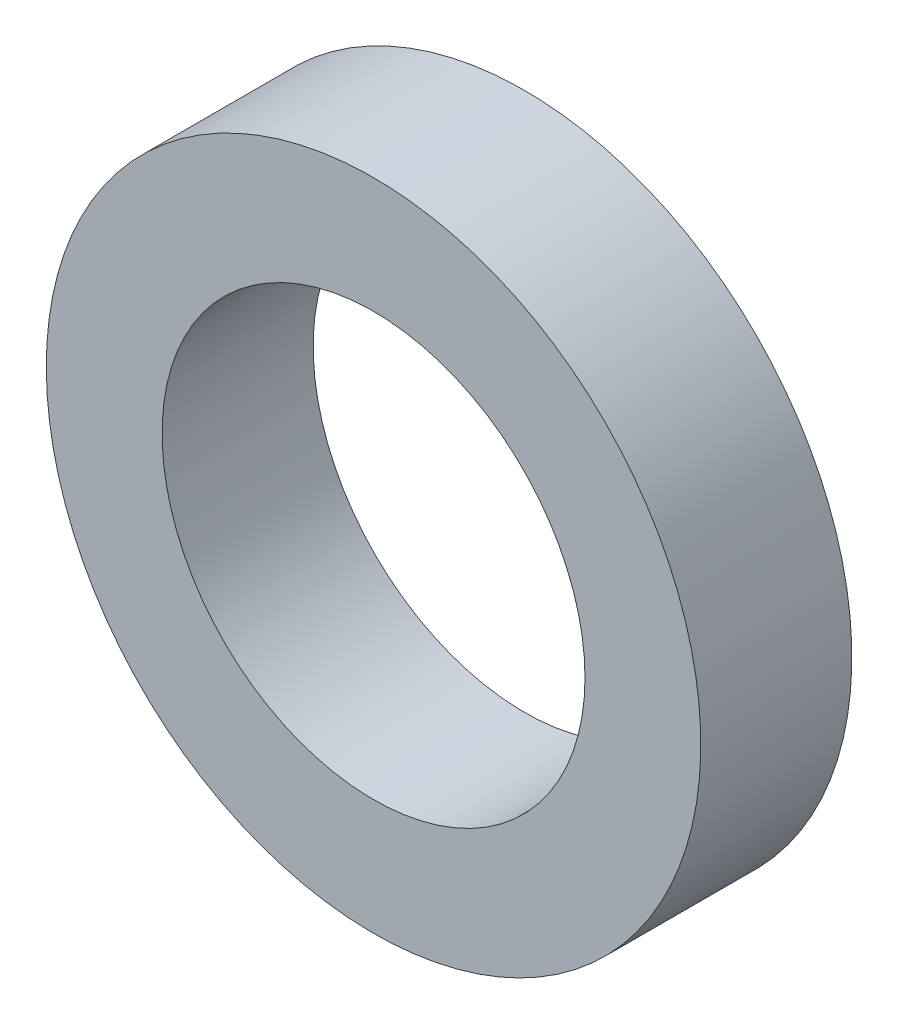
ISO-10303-21;
HEADER;
FILE_DESCRIPTION(('STEP AP214'),'2;1');
FILE_NAME('part.step','',(''),(''),'','','');
FILE_SCHEMA(('AUTOMOTIVE_DESIGN { 1 0 10303 214 1 1 1 1 }'));
ENDSEC;
DATA;
#1=APPLICATION_CONTEXT('core data for automotive mechanical design processes');
#2=APPLICATION_PROTOCOL_DEFINITION('international standard','automotive_design',2000,#1);
#3=PRODUCT_CONTEXT('',#1,'mechanical');
#4=PRODUCT('Part','Part','',(#3));
#5=PRODUCT_RELATED_PRODUCT_CATEGORY('part','',(#4));
#6=PRODUCT_DEFINITION_FORMATION('','',#4);
#7=PRODUCT_DEFINITION_CONTEXT('part definition',#1,'design');
#8=PRODUCT_DEFINITION('design','',#6,#7);
#9=PRODUCT_DEFINITION_SHAPE('','',#8);
#10=(LENGTH_UNIT() NAMED_UNIT(*) SI_UNIT(.MILLI.,.METRE.));
#11=(NAMED_UNIT(*) PLANE_ANGLE_UNIT() SI_UNIT($,.RADIAN.));
#12=(NAMED_UNIT(*) SI_UNIT($,.STERADIAN.) SOLID_ANGLE_UNIT());
#13=UNCERTAINTY_MEASURE_WITH_UNIT(LENGTH_MEASURE(1.E-05),#10,'distance_accuracy_value','');
#14=(GEOMETRIC_REPRESENTATION_CONTEXT(3) GLOBAL_UNCERTAINTY_ASSIGNED_CONTEXT((#13)) GLOBAL_UNIT_ASSIGNED_CONTEXT((#10,
#11,#12)) REPRESENTATION_CONTEXT('',''));
#15=CARTESIAN_POINT('',(0.,0.,0.));
#16=DIRECTION('',(0.,0.,1.));
#17=DIRECTION('',(1.,0.,0.));
#18=AXIS2_PLACEMENT_3D('',#15,#16,#17);
#19=CARTESIAN_POINT('',(0.,0.,3.));
#20=DIRECTION('',(0.,0.,1.));
#21=DIRECTION('',(-0.978505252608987,-0.206221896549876,0.));
#22=AXIS2_PLACEMENT_3D('',#19,#20,#21);
#23=PLANE('',#22);
#24=CARTESIAN_POINT('',(0.,0.,3.));
#25=DIRECTION('',(0.,0.,1.));
#26=DIRECTION('',(-0.978505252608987,-0.206221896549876,0.));
#27=AXIS2_PLACEMENT_3D('',#24,#25,#26);
#28=CIRCLE('',#27,6.5);
#29=CARTESIAN_POINT('',(-6.36028414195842,-1.3404423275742,3.));
#30=VERTEX_POINT('',#29);
#31=EDGE_CURVE('E8',#30,#30,#28,.T.);
#32=ORIENTED_EDGE('',*,*,#31,.T.);
#33=EDGE_LOOP('',(#32));
#34=FACE_BOUND('',#33,.T.);
#35=CARTESIAN_POINT('',(0.,0.,3.));
#36=DIRECTION('',(0.,0.,1.));
#37=DIRECTION('',(-0.978505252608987,-0.206221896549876,0.));
#38=AXIS2_PLACEMENT_3D('',#35,#36,#37);
#39=CIRCLE('',#38,4.2);
#40=CARTESIAN_POINT('',(-4.10972206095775,-0.866131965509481,3.));
#41=VERTEX_POINT('',#40);
#42=EDGE_CURVE('E23',#41,#41,#39,.T.);
#43=ORIENTED_EDGE('',*,*,#42,.F.);
#44=EDGE_LOOP('',(#43));
#45=FACE_BOUND('',#44,.T.);
#46=ADVANCED_FACE('F12',(#34,#45),#23,.T.);
#47=CARTESIAN_POINT('',(0.,0.,0.));
#48=DIRECTION('',(0.,0.,1.));
#49=DIRECTION('',(-0.978505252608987,-0.206221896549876,0.));
#50=AXIS2_PLACEMENT_3D('',#47,#48,#49);
#51=PLANE('',#50);
#52=CARTESIAN_POINT('',(0.,0.,0.));
#53=DIRECTION('',(0.,0.,1.));
#54=DIRECTION('',(-0.978505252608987,-0.206221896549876,0.));
#55=AXIS2_PLACEMENT_3D('',#52,#53,#54);
#56=CIRCLE('',#55,6.5);
#57=CARTESIAN_POINT('',(-6.36028414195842,-1.3404423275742,0.));
#58=VERTEX_POINT('',#57);
#59=EDGE_CURVE('E19',#58,#58,#56,.T.);
#60=ORIENTED_EDGE('',*,*,#59,.F.);
#61=EDGE_LOOP('',(#60));
#62=FACE_BOUND('',#61,.T.);
#63=CARTESIAN_POINT('',(0.,0.,0.));
#64=DIRECTION('',(0.,0.,1.));
#65=DIRECTION('',(-0.978505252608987,-0.206221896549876,0.));
#66=AXIS2_PLACEMENT_3D('',#63,#64,#65);
#67=CIRCLE('',#66,4.2);
#68=CARTESIAN_POINT('',(-4.10972206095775,-0.866131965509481,0.));
#69=VERTEX_POINT('',#68);
#70=EDGE_CURVE('E27',#69,#69,#67,.T.);
#71=ORIENTED_EDGE('',*,*,#70,.T.);
#72=EDGE_LOOP('',(#71));
#73=FACE_BOUND('',#72,.T.);
#74=ADVANCED_FACE('F33',(#62,#73),#51,.F.);
#75=CARTESIAN_POINT('',(0.,0.,3.));
#76=DIRECTION('',(0.,0.,-1.));
#77=DIRECTION('',(0.978505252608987,0.206221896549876,0.));
#78=AXIS2_PLACEMENT_3D('',#75,#76,#77);
#79=CYLINDRICAL_SURFACE('',#78,6.5);
#80=ORIENTED_EDGE('',*,*,#31,.F.);
#81=EDGE_LOOP('',(#80));
#82=FACE_BOUND('',#81,.T.);
#83=ORIENTED_EDGE('',*,*,#59,.T.);
#84=EDGE_LOOP('',(#83));
#85=FACE_BOUND('',#84,.T.);
#86=ADVANCED_FACE('F14',(#82,#85),#79,.T.);
#87=CARTESIAN_POINT('',(0.,0.,3.));
#88=DIRECTION('',(0.,0.,-1.));
#89=DIRECTION('',(0.978505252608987,0.206221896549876,0.));
#90=AXIS2_PLACEMENT_3D('',#87,#88,#89);
#91=CYLINDRICAL_SURFACE('',#90,4.2);
#92=ORIENTED_EDGE('',*,*,#42,.T.);
#93=EDGE_LOOP('',(#92));
#94=FACE_BOUND('',#93,.T.);
#95=ORIENTED_EDGE('',*,*,#70,.F.);
#96=EDGE_LOOP('',(#95));
#97=FACE_BOUND('',#96,.T.);
#98=ADVANCED_FACE('F35',(#94,#97),#91,.F.);
#99=CLOSED_SHELL('',(#46,#74,#86,#98));
#100=MANIFOLD_SOLID_BREP('B1',#99);
#101=ADVANCED_BREP_SHAPE_REPRESENTATION('',(#18,#100),#14);
#102=SHAPE_DEFINITION_REPRESENTATION(#9,#101);
ENDSEC;
END-ISO-10303-21;
